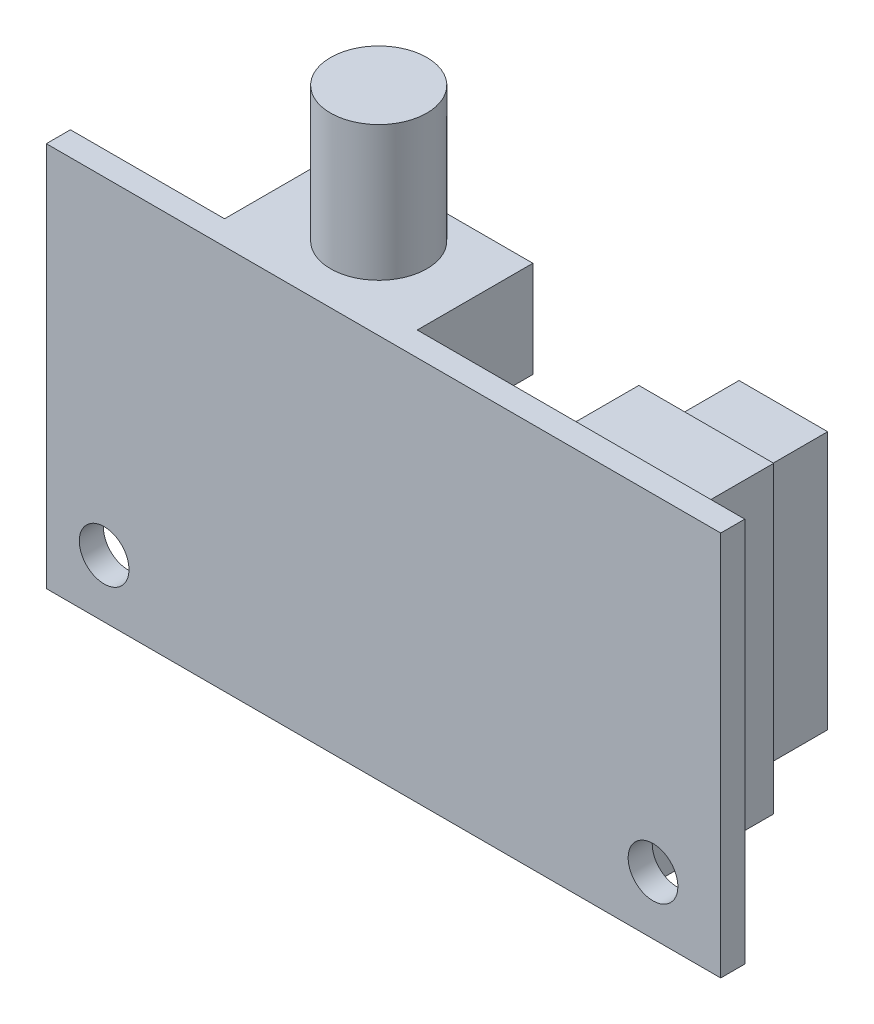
ISO-10303-21;
HEADER;
FILE_DESCRIPTION(('STEP AP214'),'2;1');
FILE_NAME('part.step','',(''),(''),'','','');
FILE_SCHEMA(('AUTOMOTIVE_DESIGN { 1 0 10303 214 1 1 1 1 }'));
ENDSEC;
DATA;
#1=APPLICATION_CONTEXT('core data for automotive mechanical design processes');
#2=APPLICATION_PROTOCOL_DEFINITION('international standard','automotive_design',2000,#1);
#3=PRODUCT_CONTEXT('',#1,'mechanical');
#4=PRODUCT('Part','Part','',(#3));
#5=PRODUCT_RELATED_PRODUCT_CATEGORY('part','',(#4));
#6=PRODUCT_DEFINITION_FORMATION('','',#4);
#7=PRODUCT_DEFINITION_CONTEXT('part definition',#1,'design');
#8=PRODUCT_DEFINITION('design','',#6,#7);
#9=PRODUCT_DEFINITION_SHAPE('','',#8);
#10=(LENGTH_UNIT() NAMED_UNIT(*) SI_UNIT(.MILLI.,.METRE.));
#11=(NAMED_UNIT(*) PLANE_ANGLE_UNIT() SI_UNIT($,.RADIAN.));
#12=(NAMED_UNIT(*) SI_UNIT($,.STERADIAN.) SOLID_ANGLE_UNIT());
#13=UNCERTAINTY_MEASURE_WITH_UNIT(LENGTH_MEASURE(1.E-05),#10,'distance_accuracy_value','');
#14=(GEOMETRIC_REPRESENTATION_CONTEXT(3) GLOBAL_UNCERTAINTY_ASSIGNED_CONTEXT((#13)) GLOBAL_UNIT_ASSIGNED_CONTEXT((#10,
#11,#12)) REPRESENTATION_CONTEXT('',''));
#15=CARTESIAN_POINT('',(0.,0.,0.));
#16=DIRECTION('',(0.,0.,1.));
#17=DIRECTION('',(1.,0.,0.));
#18=AXIS2_PLACEMENT_3D('',#15,#16,#17);
#19=CARTESIAN_POINT('',(-7.61999999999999,20.0152,-11.1125));
#20=DIRECTION('',(0.,0.,-1.));
#21=DIRECTION('',(-1.,0.,0.));
#22=AXIS2_PLACEMENT_3D('',#19,#20,#21);
#23=PLANE('',#22);
#24=DIRECTION('',(1.,0.,0.));
#25=VECTOR('',#24,1.);
#26=CARTESIAN_POINT('',(-16.51,20.0152,-11.1125));
#27=LINE('',#26,#25);
#28=CARTESIAN_POINT('',(-16.51,20.0152,-11.1125));
#29=VERTEX_POINT('',#28);
#30=CARTESIAN_POINT('',(-7.61999999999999,20.0152,-11.1125));
#31=VERTEX_POINT('',#30);
#32=EDGE_CURVE('E176',#29,#31,#27,.T.);
#33=ORIENTED_EDGE('',*,*,#32,.T.);
#34=DIRECTION('',(0.,-1.,0.));
#35=VECTOR('',#34,1.);
#36=CARTESIAN_POINT('',(-7.61999999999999,20.0152,-11.1125));
#37=LINE('',#36,#35);
#38=CARTESIAN_POINT('',(-7.61999999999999,0.,-11.1125));
#39=VERTEX_POINT('',#38);
#40=EDGE_CURVE('E179',#31,#39,#37,.T.);
#41=ORIENTED_EDGE('',*,*,#40,.T.);
#42=DIRECTION('',(-1.,0.,0.));
#43=VECTOR('',#42,1.);
#44=CARTESIAN_POINT('',(-7.61999999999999,0.,-11.1125));
#45=LINE('',#44,#43);
#46=CARTESIAN_POINT('',(-16.51,0.,-11.1125));
#47=VERTEX_POINT('',#46);
#48=EDGE_CURVE('E182',#39,#47,#45,.T.);
#49=ORIENTED_EDGE('',*,*,#48,.T.);
#50=DIRECTION('',(0.,1.,0.));
#51=VECTOR('',#50,1.);
#52=CARTESIAN_POINT('',(-16.51,0.,-11.1125));
#53=LINE('',#52,#51);
#54=EDGE_CURVE('E184',#47,#29,#53,.T.);
#55=ORIENTED_EDGE('',*,*,#54,.T.);
#56=EDGE_LOOP('',(#33,#41,#49,#55));
#57=FACE_BOUND('',#56,.T.);
#58=DIRECTION('',(1.,0.,0.));
#59=VECTOR('',#58,1.);
#60=CARTESIAN_POINT('',(-14.986,18.5166,-11.1125));
#61=LINE('',#60,#59);
#62=CARTESIAN_POINT('',(-14.986,18.5166,-11.1125));
#63=VERTEX_POINT('',#62);
#64=CARTESIAN_POINT('',(-9.14399999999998,18.5166,-11.1125));
#65=VERTEX_POINT('',#64);
#66=EDGE_CURVE('E528',#63,#65,#61,.T.);
#67=ORIENTED_EDGE('',*,*,#66,.F.);
#68=DIRECTION('',(0.,1.,0.));
#69=VECTOR('',#68,1.);
#70=CARTESIAN_POINT('',(-14.986,18.5166,-11.1125));
#71=LINE('',#70,#69);
#72=CARTESIAN_POINT('',(-14.986,1.4986,-11.1125));
#73=VERTEX_POINT('',#72);
#74=EDGE_CURVE('E167',#73,#63,#71,.T.);
#75=ORIENTED_EDGE('',*,*,#74,.F.);
#76=DIRECTION('',(-1.,0.,0.));
#77=VECTOR('',#76,1.);
#78=CARTESIAN_POINT('',(-14.986,1.4986,-11.1125));
#79=LINE('',#78,#77);
#80=CARTESIAN_POINT('',(-9.14399999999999,1.49860000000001,-11.1125));
#81=VERTEX_POINT('',#80);
#82=EDGE_CURVE('E163',#81,#73,#79,.T.);
#83=ORIENTED_EDGE('',*,*,#82,.F.);
#84=DIRECTION('',(0.,-1.,0.));
#85=VECTOR('',#84,1.);
#86=CARTESIAN_POINT('',(-9.14399999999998,18.5166,-11.1125));
#87=LINE('',#86,#85);
#88=EDGE_CURVE('E525',#65,#81,#87,.T.);
#89=ORIENTED_EDGE('',*,*,#88,.F.);
#90=EDGE_LOOP('',(#67,#75,#83,#89));
#91=FACE_BOUND('',#90,.T.);
#92=ADVANCED_FACE('F31',(#57,#91),#23,.T.);
#93=CARTESIAN_POINT('',(0.,7.84644021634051,-1.5875));
#94=DIRECTION('',(0.,0.,-1.));
#95=DIRECTION('',(-1.,0.,0.));
#96=AXIS2_PLACEMENT_3D('',#93,#94,#95);
#97=PLANE('',#96);
#98=CARTESIAN_POINT('',(-40.64,3.81,-1.5875));
#99=DIRECTION('',(0.,0.,-1.));
#100=DIRECTION('',(-1.,0.,0.));
#101=AXIS2_PLACEMENT_3D('',#98,#99,#100);
#102=CIRCLE('',#101,1.6383);
#103=CARTESIAN_POINT('',(-42.2783,3.81,-1.5875));
#104=VERTEX_POINT('',#103);
#105=EDGE_CURVE('E297',#104,#104,#102,.T.);
#106=ORIENTED_EDGE('',*,*,#105,.F.);
#107=EDGE_LOOP('',(#106));
#108=FACE_BOUND('',#107,.T.);
#109=CARTESIAN_POINT('',(-4.46387065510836,3.81,-1.5875));
#110=DIRECTION('',(0.,0.,-1.));
#111=DIRECTION('',(-1.,0.,0.));
#112=AXIS2_PLACEMENT_3D('',#109,#110,#111);
#113=CIRCLE('',#112,1.6383);
#114=CARTESIAN_POINT('',(-6.10217065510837,3.81,-1.5875));
#115=VERTEX_POINT('',#114);
#116=EDGE_CURVE('E251',#115,#115,#113,.T.);
#117=ORIENTED_EDGE('',*,*,#116,.F.);
#118=EDGE_LOOP('',(#117));
#119=FACE_BOUND('',#118,.T.);
#120=DIRECTION('',(-1.,0.,0.));
#121=VECTOR('',#120,1.);
#122=CARTESIAN_POINT('',(0.,0.,-1.5875));
#123=LINE('',#122,#121);
#124=CARTESIAN_POINT('',(0.,0.,-1.5875));
#125=VERTEX_POINT('',#124);
#126=CARTESIAN_POINT('',(-7.61999999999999,0.,-1.5875));
#127=VERTEX_POINT('',#126);
#128=EDGE_CURVE('E288',#125,#127,#123,.T.);
#129=ORIENTED_EDGE('',*,*,#128,.T.);
#130=DIRECTION('',(0.,-1.,0.));
#131=VECTOR('',#130,1.);
#132=CARTESIAN_POINT('',(-7.61999999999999,20.0152,-1.5875));
#133=LINE('',#132,#131);
#134=CARTESIAN_POINT('',(-7.61999999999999,20.0152,-1.5875));
#135=VERTEX_POINT('',#134);
#136=EDGE_CURVE('E54',#135,#127,#133,.T.);
#137=ORIENTED_EDGE('',*,*,#136,.F.);
#138=DIRECTION('',(1.,0.,0.));
#139=VECTOR('',#138,1.);
#140=CARTESIAN_POINT('',(-16.51,20.0152,-1.5875));
#141=LINE('',#140,#139);
#142=CARTESIAN_POINT('',(-16.51,20.0152,-1.5875));
#143=VERTEX_POINT('',#142);
#144=EDGE_CURVE('E169',#143,#135,#141,.T.);
#145=ORIENTED_EDGE('',*,*,#144,.F.);
#146=DIRECTION('',(0.,1.,0.));
#147=VECTOR('',#146,1.);
#148=CARTESIAN_POINT('',(-16.51,0.,-1.5875));
#149=LINE('',#148,#147);
#150=CARTESIAN_POINT('',(-16.51,0.,-1.5875));
#151=VERTEX_POINT('',#150);
#152=EDGE_CURVE('E180',#151,#143,#149,.T.);
#153=ORIENTED_EDGE('',*,*,#152,.F.);
#154=CARTESIAN_POINT('',(-44.45,0.,-1.5875));
#155=VERTEX_POINT('',#154);
#156=EDGE_CURVE('E256',#151,#155,#123,.T.);
#157=ORIENTED_EDGE('',*,*,#156,.T.);
#158=DIRECTION('',(0.,1.,0.));
#159=VECTOR('',#158,1.);
#160=CARTESIAN_POINT('',(-44.45,0.,-1.5875));
#161=LINE('',#160,#159);
#162=CARTESIAN_POINT('',(-44.45,25.4,-1.5875));
#163=VERTEX_POINT('',#162);
#164=EDGE_CURVE('E241',#155,#163,#161,.T.);
#165=ORIENTED_EDGE('',*,*,#164,.T.);
#166=DIRECTION('',(1.,0.,0.));
#167=VECTOR('',#166,1.);
#168=CARTESIAN_POINT('',(0.,25.4,-1.5875));
#169=LINE('',#168,#167);
#170=CARTESIAN_POINT('',(-34.29,25.4,-1.5875));
#171=VERTEX_POINT('',#170);
#172=EDGE_CURVE('E240',#163,#171,#169,.T.);
#173=ORIENTED_EDGE('',*,*,#172,.T.);
#174=DIRECTION('',(0.,1.,0.));
#175=VECTOR('',#174,1.);
#176=CARTESIAN_POINT('',(-34.29,19.05,-1.5875));
#177=LINE('',#176,#175);
#178=CARTESIAN_POINT('',(-34.29,19.05,-1.5875));
#179=VERTEX_POINT('',#178);
#180=EDGE_CURVE('E203',#179,#171,#177,.T.);
#181=ORIENTED_EDGE('',*,*,#180,.F.);
#182=DIRECTION('',(-1.,0.,0.));
#183=VECTOR('',#182,1.);
#184=CARTESIAN_POINT('',(-34.29,19.05,-1.5875));
#185=LINE('',#184,#183);
#186=CARTESIAN_POINT('',(-21.59,19.05,-1.5875));
#187=VERTEX_POINT('',#186);
#188=EDGE_CURVE('E208',#187,#179,#185,.T.);
#189=ORIENTED_EDGE('',*,*,#188,.F.);
#190=DIRECTION('',(0.,-1.,0.));
#191=VECTOR('',#190,1.);
#192=CARTESIAN_POINT('',(-21.59,19.05,-1.5875));
#193=LINE('',#192,#191);
#194=CARTESIAN_POINT('',(-21.59,25.4,-1.5875));
#195=VERTEX_POINT('',#194);
#196=EDGE_CURVE('E220',#195,#187,#193,.T.);
#197=ORIENTED_EDGE('',*,*,#196,.F.);
#198=CARTESIAN_POINT('',(0.,25.4,-1.5875));
#199=VERTEX_POINT('',#198);
#200=EDGE_CURVE('E237',#195,#199,#169,.T.);
#201=ORIENTED_EDGE('',*,*,#200,.T.);
#202=DIRECTION('',(0.,1.,0.));
#203=VECTOR('',#202,1.);
#204=CARTESIAN_POINT('',(0.,25.3365678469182,-1.5875));
#205=LINE('',#204,#203);
#206=EDGE_CURVE('E39',#125,#199,#205,.T.);
#207=ORIENTED_EDGE('',*,*,#206,.F.);
#208=EDGE_LOOP('',(#129,#137,#145,#153,#157,#165,#173,#181,#189,#197,#201,#207));
#209=FACE_BOUND('',#208,.T.);
#210=ADVANCED_FACE('F287',(#108,#119,#209),#97,.T.);
#211=CARTESIAN_POINT('',(0.,25.4,-1.5875));
#212=DIRECTION('',(0.,-1.,0.));
#213=DIRECTION('',(0.,0.,-1.));
#214=AXIS2_PLACEMENT_3D('',#211,#212,#213);
#215=PLANE('',#214);
#216=DIRECTION('',(1.,0.,0.));
#217=VECTOR('',#216,1.);
#218=CARTESIAN_POINT('',(0.,25.4,0.));
#219=LINE('',#218,#217);
#220=CARTESIAN_POINT('',(-44.45,25.4,0.));
#221=VERTEX_POINT('',#220);
#222=CARTESIAN_POINT('',(0.,25.4,0.));
#223=VERTEX_POINT('',#222);
#224=EDGE_CURVE('E253',#221,#223,#219,.T.);
#225=ORIENTED_EDGE('',*,*,#224,.T.);
#226=DIRECTION('',(0.,0.,1.));
#227=VECTOR('',#226,1.);
#228=CARTESIAN_POINT('',(0.,25.4,-1.5875));
#229=LINE('',#228,#227);
#230=EDGE_CURVE('E257',#199,#223,#229,.T.);
#231=ORIENTED_EDGE('',*,*,#230,.F.);
#232=ORIENTED_EDGE('',*,*,#200,.F.);
#233=DIRECTION('',(0.,0.,1.));
#234=VECTOR('',#233,1.);
#235=CARTESIAN_POINT('',(-21.59,25.4,-9.2075));
#236=LINE('',#235,#234);
#237=CARTESIAN_POINT('',(-21.59,25.4,-9.2075));
#238=VERTEX_POINT('',#237);
#239=EDGE_CURVE('E227',#238,#195,#236,.T.);
#240=ORIENTED_EDGE('',*,*,#239,.F.);
#241=DIRECTION('',(1.,0.,0.));
#242=VECTOR('',#241,1.);
#243=CARTESIAN_POINT('',(-34.29,25.4,-9.2075));
#244=LINE('',#243,#242);
#245=CARTESIAN_POINT('',(-34.29,25.4,-9.2075));
#246=VERTEX_POINT('',#245);
#247=EDGE_CURVE('E207',#246,#238,#244,.T.);
#248=ORIENTED_EDGE('',*,*,#247,.F.);
#249=DIRECTION('',(0.,0.,1.));
#250=VECTOR('',#249,1.);
#251=CARTESIAN_POINT('',(-34.29,25.4,-9.2075));
#252=LINE('',#251,#250);
#253=EDGE_CURVE('E223',#246,#171,#252,.T.);
#254=ORIENTED_EDGE('',*,*,#253,.T.);
#255=ORIENTED_EDGE('',*,*,#172,.F.);
#256=DIRECTION('',(0.,0.,1.));
#257=VECTOR('',#256,1.);
#258=CARTESIAN_POINT('',(-44.45,25.4,-1.5875));
#259=LINE('',#258,#257);
#260=EDGE_CURVE('E260',#163,#221,#259,.T.);
#261=ORIENTED_EDGE('',*,*,#260,.T.);
#262=EDGE_LOOP('',(#225,#231,#232,#240,#248,#254,#255,#261));
#263=FACE_BOUND('',#262,.T.);
#264=CARTESIAN_POINT('',(-27.94,25.4,-5.3975));
#265=DIRECTION('',(0.,-1.,0.));
#266=DIRECTION('',(0.,0.,-1.));
#267=AXIS2_PLACEMENT_3D('',#264,#265,#266);
#268=CIRCLE('',#267,3.175);
#269=CARTESIAN_POINT('',(-27.94,25.4,-8.5725));
#270=VERTEX_POINT('',#269);
#271=EDGE_CURVE('E11',#270,#270,#268,.F.);
#272=ORIENTED_EDGE('',*,*,#271,.F.);
#273=EDGE_LOOP('',(#272));
#274=FACE_BOUND('',#273,.T.);
#275=ADVANCED_FACE('F281',(#263,#274),#215,.F.);
#276=CARTESIAN_POINT('',(0.,7.84644021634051,0.));
#277=DIRECTION('',(0.,0.,-1.));
#278=DIRECTION('',(-1.,0.,0.));
#279=AXIS2_PLACEMENT_3D('',#276,#277,#278);
#280=PLANE('',#279);
#281=CARTESIAN_POINT('',(-4.46387065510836,3.81,0.));
#282=DIRECTION('',(0.,0.,-1.));
#283=DIRECTION('',(-1.,0.,0.));
#284=AXIS2_PLACEMENT_3D('',#281,#282,#283);
#285=CIRCLE('',#284,1.6383);
#286=CARTESIAN_POINT('',(-6.10217065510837,3.81,0.));
#287=VERTEX_POINT('',#286);
#288=EDGE_CURVE('E294',#287,#287,#285,.T.);
#289=ORIENTED_EDGE('',*,*,#288,.T.);
#290=EDGE_LOOP('',(#289));
#291=FACE_BOUND('',#290,.T.);
#292=DIRECTION('',(-1.,0.,0.));
#293=VECTOR('',#292,1.);
#294=CARTESIAN_POINT('',(0.,0.,0.));
#295=LINE('',#294,#293);
#296=CARTESIAN_POINT('',(0.,0.,0.));
#297=VERTEX_POINT('',#296);
#298=CARTESIAN_POINT('',(-44.45,0.,0.));
#299=VERTEX_POINT('',#298);
#300=EDGE_CURVE('E247',#297,#299,#295,.T.);
#301=ORIENTED_EDGE('',*,*,#300,.F.);
#302=DIRECTION('',(0.,1.,0.));
#303=VECTOR('',#302,1.);
#304=CARTESIAN_POINT('',(0.,25.3365678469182,0.));
#305=LINE('',#304,#303);
#306=EDGE_CURVE('E269',#297,#223,#305,.T.);
#307=ORIENTED_EDGE('',*,*,#306,.T.);
#308=ORIENTED_EDGE('',*,*,#224,.F.);
#309=DIRECTION('',(0.,1.,0.));
#310=VECTOR('',#309,1.);
#311=CARTESIAN_POINT('',(-44.45,0.,0.));
#312=LINE('',#311,#310);
#313=EDGE_CURVE('E250',#299,#221,#312,.T.);
#314=ORIENTED_EDGE('',*,*,#313,.F.);
#315=EDGE_LOOP('',(#301,#307,#308,#314));
#316=FACE_BOUND('',#315,.T.);
#317=CARTESIAN_POINT('',(-40.64,3.81,0.));
#318=DIRECTION('',(0.,0.,-1.));
#319=DIRECTION('',(-1.,0.,0.));
#320=AXIS2_PLACEMENT_3D('',#317,#318,#319);
#321=CIRCLE('',#320,1.6383);
#322=CARTESIAN_POINT('',(-42.2783,3.81,0.));
#323=VERTEX_POINT('',#322);
#324=EDGE_CURVE('E226',#323,#323,#321,.T.);
#325=ORIENTED_EDGE('',*,*,#324,.T.);
#326=EDGE_LOOP('',(#325));
#327=FACE_BOUND('',#326,.T.);
#328=ADVANCED_FACE('F274',(#291,#316,#327),#280,.F.);
#329=CARTESIAN_POINT('',(0.,0.,-1.5875));
#330=DIRECTION('',(0.,1.,0.));
#331=DIRECTION('',(0.,0.,1.));
#332=AXIS2_PLACEMENT_3D('',#329,#330,#331);
#333=PLANE('',#332);
#334=ORIENTED_EDGE('',*,*,#300,.T.);
#335=DIRECTION('',(0.,0.,1.));
#336=VECTOR('',#335,1.);
#337=CARTESIAN_POINT('',(-44.45,0.,-1.5875));
#338=LINE('',#337,#336);
#339=EDGE_CURVE('E263',#155,#299,#338,.T.);
#340=ORIENTED_EDGE('',*,*,#339,.F.);
#341=ORIENTED_EDGE('',*,*,#156,.F.);
#342=DIRECTION('',(0.,0.,1.));
#343=VECTOR('',#342,1.);
#344=CARTESIAN_POINT('',(-16.51,0.,-11.1125));
#345=LINE('',#344,#343);
#346=EDGE_CURVE('E192',#47,#151,#345,.T.);
#347=ORIENTED_EDGE('',*,*,#346,.F.);
#348=ORIENTED_EDGE('',*,*,#48,.F.);
#349=DIRECTION('',(0.,0.,1.));
#350=VECTOR('',#349,1.);
#351=CARTESIAN_POINT('',(-7.61999999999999,0.,-11.1125));
#352=LINE('',#351,#350);
#353=EDGE_CURVE('E195',#39,#127,#352,.T.);
#354=ORIENTED_EDGE('',*,*,#353,.T.);
#355=ORIENTED_EDGE('',*,*,#128,.F.);
#356=DIRECTION('',(0.,0.,1.));
#357=VECTOR('',#356,1.);
#358=CARTESIAN_POINT('',(0.,0.,-1.5875));
#359=LINE('',#358,#357);
#360=EDGE_CURVE('E266',#125,#297,#359,.T.);
#361=ORIENTED_EDGE('',*,*,#360,.T.);
#362=EDGE_LOOP('',(#334,#340,#341,#347,#348,#354,#355,#361));
#363=FACE_BOUND('',#362,.T.);
#364=ADVANCED_FACE('F290',(#363),#333,.F.);
#365=CARTESIAN_POINT('',(-44.45,0.,-1.5875));
#366=DIRECTION('',(1.,0.,0.));
#367=DIRECTION('',(0.,0.,-1.));
#368=AXIS2_PLACEMENT_3D('',#365,#366,#367);
#369=PLANE('',#368);
#370=ORIENTED_EDGE('',*,*,#313,.T.);
#371=ORIENTED_EDGE('',*,*,#260,.F.);
#372=ORIENTED_EDGE('',*,*,#164,.F.);
#373=ORIENTED_EDGE('',*,*,#339,.T.);
#374=EDGE_LOOP('',(#370,#371,#372,#373));
#375=FACE_BOUND('',#374,.T.);
#376=ADVANCED_FACE('F374',(#375),#369,.F.);
#377=CARTESIAN_POINT('',(0.,25.3365678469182,-1.5875));
#378=DIRECTION('',(1.,0.,0.));
#379=DIRECTION('',(0.,0.,-1.));
#380=AXIS2_PLACEMENT_3D('',#377,#378,#379);
#381=PLANE('',#380);
#382=ORIENTED_EDGE('',*,*,#306,.F.);
#383=ORIENTED_EDGE('',*,*,#360,.F.);
#384=ORIENTED_EDGE('',*,*,#206,.T.);
#385=ORIENTED_EDGE('',*,*,#230,.T.);
#386=EDGE_LOOP('',(#382,#383,#384,#385));
#387=FACE_BOUND('',#386,.T.);
#388=ADVANCED_FACE('F33',(#387),#381,.T.);
#389=CARTESIAN_POINT('',(-4.46387065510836,3.81,-1.5875));
#390=DIRECTION('',(0.,0.,1.));
#391=DIRECTION('',(1.,0.,0.));
#392=AXIS2_PLACEMENT_3D('',#389,#390,#391);
#393=CYLINDRICAL_SURFACE('',#392,1.6383);
#394=ORIENTED_EDGE('',*,*,#116,.T.);
#395=EDGE_LOOP('',(#394));
#396=FACE_BOUND('',#395,.T.);
#397=ORIENTED_EDGE('',*,*,#288,.F.);
#398=EDGE_LOOP('',(#397));
#399=FACE_BOUND('',#398,.T.);
#400=ADVANCED_FACE('F372',(#396,#399),#393,.F.);
#401=CARTESIAN_POINT('',(-40.64,3.81,-1.5875));
#402=DIRECTION('',(0.,0.,1.));
#403=DIRECTION('',(1.,0.,0.));
#404=AXIS2_PLACEMENT_3D('',#401,#402,#403);
#405=CYLINDRICAL_SURFACE('',#404,1.6383);
#406=ORIENTED_EDGE('',*,*,#105,.T.);
#407=EDGE_LOOP('',(#406));
#408=FACE_BOUND('',#407,.T.);
#409=ORIENTED_EDGE('',*,*,#324,.F.);
#410=EDGE_LOOP('',(#409));
#411=FACE_BOUND('',#410,.T.);
#412=ADVANCED_FACE('F400',(#408,#411),#405,.F.);
#413=CARTESIAN_POINT('',(-34.29,19.05,-9.2075));
#414=DIRECTION('',(1.,0.,0.));
#415=DIRECTION('',(0.,0.,-1.));
#416=AXIS2_PLACEMENT_3D('',#413,#414,#415);
#417=PLANE('',#416);
#418=ORIENTED_EDGE('',*,*,#180,.T.);
#419=ORIENTED_EDGE('',*,*,#253,.F.);
#420=DIRECTION('',(0.,1.,0.));
#421=VECTOR('',#420,1.);
#422=CARTESIAN_POINT('',(-34.29,19.05,-9.2075));
#423=LINE('',#422,#421);
#424=CARTESIAN_POINT('',(-34.29,19.05,-9.2075));
#425=VERTEX_POINT('',#424);
#426=EDGE_CURVE('E204',#425,#246,#423,.T.);
#427=ORIENTED_EDGE('',*,*,#426,.F.);
#428=DIRECTION('',(0.,0.,1.));
#429=VECTOR('',#428,1.);
#430=CARTESIAN_POINT('',(-34.29,19.05,-9.2075));
#431=LINE('',#430,#429);
#432=EDGE_CURVE('E214',#425,#179,#431,.T.);
#433=ORIENTED_EDGE('',*,*,#432,.T.);
#434=EDGE_LOOP('',(#418,#419,#427,#433));
#435=FACE_BOUND('',#434,.T.);
#436=ADVANCED_FACE('F309',(#435),#417,.F.);
#437=CARTESIAN_POINT('',(-21.59,19.05,-9.2075));
#438=DIRECTION('',(-1.,0.,0.));
#439=DIRECTION('',(0.,0.,1.));
#440=AXIS2_PLACEMENT_3D('',#437,#438,#439);
#441=PLANE('',#440);
#442=ORIENTED_EDGE('',*,*,#196,.T.);
#443=DIRECTION('',(0.,0.,1.));
#444=VECTOR('',#443,1.);
#445=CARTESIAN_POINT('',(-21.59,19.05,-9.2075));
#446=LINE('',#445,#444);
#447=CARTESIAN_POINT('',(-21.59,19.05,-9.2075));
#448=VERTEX_POINT('',#447);
#449=EDGE_CURVE('E232',#448,#187,#446,.T.);
#450=ORIENTED_EDGE('',*,*,#449,.F.);
#451=DIRECTION('',(0.,-1.,0.));
#452=VECTOR('',#451,1.);
#453=CARTESIAN_POINT('',(-21.59,19.05,-9.2075));
#454=LINE('',#453,#452);
#455=EDGE_CURVE('E210',#238,#448,#454,.T.);
#456=ORIENTED_EDGE('',*,*,#455,.F.);
#457=ORIENTED_EDGE('',*,*,#239,.T.);
#458=EDGE_LOOP('',(#442,#450,#456,#457));
#459=FACE_BOUND('',#458,.T.);
#460=ADVANCED_FACE('F317',(#459),#441,.F.);
#461=CARTESIAN_POINT('',(-34.29,19.05,-9.2075));
#462=DIRECTION('',(0.,1.,0.));
#463=DIRECTION('',(0.,0.,1.));
#464=AXIS2_PLACEMENT_3D('',#461,#462,#463);
#465=PLANE('',#464);
#466=ORIENTED_EDGE('',*,*,#188,.T.);
#467=ORIENTED_EDGE('',*,*,#432,.F.);
#468=DIRECTION('',(-1.,0.,0.));
#469=VECTOR('',#468,1.);
#470=CARTESIAN_POINT('',(-34.29,19.05,-9.2075));
#471=LINE('',#470,#469);
#472=EDGE_CURVE('E212',#448,#425,#471,.T.);
#473=ORIENTED_EDGE('',*,*,#472,.F.);
#474=ORIENTED_EDGE('',*,*,#449,.T.);
#475=EDGE_LOOP('',(#466,#467,#473,#474));
#476=FACE_BOUND('',#475,.T.);
#477=ADVANCED_FACE('F314',(#476),#465,.F.);
#478=CARTESIAN_POINT('',(-34.29,19.05,-9.2075));
#479=DIRECTION('',(0.,0.,-1.));
#480=DIRECTION('',(-1.,0.,0.));
#481=AXIS2_PLACEMENT_3D('',#478,#479,#480);
#482=PLANE('',#481);
#483=ORIENTED_EDGE('',*,*,#426,.T.);
#484=ORIENTED_EDGE('',*,*,#247,.T.);
#485=ORIENTED_EDGE('',*,*,#455,.T.);
#486=ORIENTED_EDGE('',*,*,#472,.T.);
#487=EDGE_LOOP('',(#483,#484,#485,#486));
#488=FACE_BOUND('',#487,.T.);
#489=ADVANCED_FACE('F321',(#488),#482,.T.);
#490=CARTESIAN_POINT('',(-27.94,34.29,-5.3975));
#491=DIRECTION('',(0.,-1.,0.));
#492=DIRECTION('',(1.,0.,0.));
#493=AXIS2_PLACEMENT_3D('',#490,#491,#492);
#494=CYLINDRICAL_SURFACE('',#493,3.175);
#495=CARTESIAN_POINT('',(-27.94,34.29,-5.3975));
#496=DIRECTION('',(0.,1.,0.));
#497=DIRECTION('',(-1.,0.,0.));
#498=AXIS2_PLACEMENT_3D('',#495,#496,#497);
#499=CIRCLE('',#498,3.175);
#500=CARTESIAN_POINT('',(-31.115,34.29,-5.3975));
#501=VERTEX_POINT('',#500);
#502=EDGE_CURVE('E200',#501,#501,#499,.T.);
#503=ORIENTED_EDGE('',*,*,#502,.F.);
#504=EDGE_LOOP('',(#503));
#505=FACE_BOUND('',#504,.T.);
#506=ORIENTED_EDGE('',*,*,#271,.T.);
#507=EDGE_LOOP('',(#506));
#508=FACE_BOUND('',#507,.T.);
#509=ADVANCED_FACE('F323',(#505,#508),#494,.T.);
#510=CARTESIAN_POINT('',(-27.94,34.29,-5.3975));
#511=DIRECTION('',(0.,1.,0.));
#512=DIRECTION('',(-1.,0.,0.));
#513=AXIS2_PLACEMENT_3D('',#510,#511,#512);
#514=PLANE('',#513);
#515=ORIENTED_EDGE('',*,*,#502,.T.);
#516=EDGE_LOOP('',(#515));
#517=FACE_BOUND('',#516,.T.);
#518=ADVANCED_FACE('F329',(#517),#514,.T.);
#519=CARTESIAN_POINT('',(-16.51,20.0152,-11.1125));
#520=DIRECTION('',(0.,-1.,0.));
#521=DIRECTION('',(1.,0.,0.));
#522=AXIS2_PLACEMENT_3D('',#519,#520,#521);
#523=PLANE('',#522);
#524=ORIENTED_EDGE('',*,*,#144,.T.);
#525=DIRECTION('',(0.,0.,1.));
#526=VECTOR('',#525,1.);
#527=CARTESIAN_POINT('',(-7.61999999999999,20.0152,-11.1125));
#528=LINE('',#527,#526);
#529=EDGE_CURVE('E198',#31,#135,#528,.T.);
#530=ORIENTED_EDGE('',*,*,#529,.F.);
#531=ORIENTED_EDGE('',*,*,#32,.F.);
#532=DIRECTION('',(0.,0.,1.));
#533=VECTOR('',#532,1.);
#534=CARTESIAN_POINT('',(-16.51,20.0152,-11.1125));
#535=LINE('',#534,#533);
#536=EDGE_CURVE('E185',#29,#143,#535,.T.);
#537=ORIENTED_EDGE('',*,*,#536,.T.);
#538=EDGE_LOOP('',(#524,#530,#531,#537));
#539=FACE_BOUND('',#538,.T.);
#540=ADVANCED_FACE('F352',(#539),#523,.F.);
#541=CARTESIAN_POINT('',(-7.61999999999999,20.0152,-11.1125));
#542=DIRECTION('',(-1.,0.,0.));
#543=DIRECTION('',(0.,-1.,0.));
#544=AXIS2_PLACEMENT_3D('',#541,#542,#543);
#545=PLANE('',#544);
#546=ORIENTED_EDGE('',*,*,#136,.T.);
#547=ORIENTED_EDGE('',*,*,#353,.F.);
#548=ORIENTED_EDGE('',*,*,#40,.F.);
#549=ORIENTED_EDGE('',*,*,#529,.T.);
#550=EDGE_LOOP('',(#546,#547,#548,#549));
#551=FACE_BOUND('',#550,.T.);
#552=ADVANCED_FACE('F348',(#551),#545,.F.);
#553=CARTESIAN_POINT('',(-16.51,0.,-11.1125));
#554=DIRECTION('',(1.,0.,0.));
#555=DIRECTION('',(0.,0.,-1.));
#556=AXIS2_PLACEMENT_3D('',#553,#554,#555);
#557=PLANE('',#556);
#558=ORIENTED_EDGE('',*,*,#152,.T.);
#559=ORIENTED_EDGE('',*,*,#536,.F.);
#560=ORIENTED_EDGE('',*,*,#54,.F.);
#561=ORIENTED_EDGE('',*,*,#346,.T.);
#562=EDGE_LOOP('',(#558,#559,#560,#561));
#563=FACE_BOUND('',#562,.T.);
#564=ADVANCED_FACE('F345',(#563),#557,.F.);
#565=CARTESIAN_POINT('',(-14.986,18.5166,-16.1925));
#566=DIRECTION('',(1.,0.,0.));
#567=DIRECTION('',(0.,1.,0.));
#568=AXIS2_PLACEMENT_3D('',#565,#566,#567);
#569=PLANE('',#568);
#570=ORIENTED_EDGE('',*,*,#74,.T.);
#571=DIRECTION('',(0.,0.,1.));
#572=VECTOR('',#571,1.);
#573=CARTESIAN_POINT('',(-14.986,18.5166,-16.1925));
#574=LINE('',#573,#572);
#575=CARTESIAN_POINT('',(-14.986,18.5166,-16.1925));
#576=VERTEX_POINT('',#575);
#577=EDGE_CURVE('E148',#576,#63,#574,.T.);
#578=ORIENTED_EDGE('',*,*,#577,.F.);
#579=DIRECTION('',(0.,1.,0.));
#580=VECTOR('',#579,1.);
#581=CARTESIAN_POINT('',(-14.986,18.5166,-16.1925));
#582=LINE('',#581,#580);
#583=CARTESIAN_POINT('',(-14.986,1.4986,-16.1925));
#584=VERTEX_POINT('',#583);
#585=EDGE_CURVE('E155',#584,#576,#582,.T.);
#586=ORIENTED_EDGE('',*,*,#585,.F.);
#587=DIRECTION('',(0.,0.,1.));
#588=VECTOR('',#587,1.);
#589=CARTESIAN_POINT('',(-14.986,1.4986,-16.1925));
#590=LINE('',#589,#588);
#591=EDGE_CURVE('E523',#584,#73,#590,.T.);
#592=ORIENTED_EDGE('',*,*,#591,.T.);
#593=EDGE_LOOP('',(#570,#578,#586,#592));
#594=FACE_BOUND('',#593,.T.);
#595=ADVANCED_FACE('F165',(#594),#569,.F.);
#596=CARTESIAN_POINT('',(-14.986,18.5166,-16.1925));
#597=DIRECTION('',(0.,-1.,0.));
#598=DIRECTION('',(1.,0.,0.));
#599=AXIS2_PLACEMENT_3D('',#596,#597,#598);
#600=PLANE('',#599);
#601=ORIENTED_EDGE('',*,*,#66,.T.);
#602=DIRECTION('',(0.,0.,1.));
#603=VECTOR('',#602,1.);
#604=CARTESIAN_POINT('',(-9.14399999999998,18.5166,-16.1925));
#605=LINE('',#604,#603);
#606=CARTESIAN_POINT('',(-9.14399999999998,18.5166,-16.1925));
#607=VERTEX_POINT('',#606);
#608=EDGE_CURVE('E151',#607,#65,#605,.T.);
#609=ORIENTED_EDGE('',*,*,#608,.F.);
#610=DIRECTION('',(1.,0.,0.));
#611=VECTOR('',#610,1.);
#612=CARTESIAN_POINT('',(-14.986,18.5166,-16.1925));
#613=LINE('',#612,#611);
#614=EDGE_CURVE('E144',#576,#607,#613,.T.);
#615=ORIENTED_EDGE('',*,*,#614,.F.);
#616=ORIENTED_EDGE('',*,*,#577,.T.);
#617=EDGE_LOOP('',(#601,#609,#615,#616));
#618=FACE_BOUND('',#617,.T.);
#619=ADVANCED_FACE('F146',(#618),#600,.F.);
#620=CARTESIAN_POINT('',(-9.14399999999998,18.5166,-16.1925));
#621=DIRECTION('',(-1.,0.,0.));
#622=DIRECTION('',(0.,-1.,0.));
#623=AXIS2_PLACEMENT_3D('',#620,#621,#622);
#624=PLANE('',#623);
#625=ORIENTED_EDGE('',*,*,#88,.T.);
#626=DIRECTION('',(0.,0.,1.));
#627=VECTOR('',#626,1.);
#628=CARTESIAN_POINT('',(-9.14399999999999,1.49860000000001,-16.1925));
#629=LINE('',#628,#627);
#630=CARTESIAN_POINT('',(-9.14399999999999,1.49860000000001,-16.1925));
#631=VERTEX_POINT('',#630);
#632=EDGE_CURVE('E46',#631,#81,#629,.T.);
#633=ORIENTED_EDGE('',*,*,#632,.F.);
#634=DIRECTION('',(0.,-1.,0.));
#635=VECTOR('',#634,1.);
#636=CARTESIAN_POINT('',(-9.14399999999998,18.5166,-16.1925));
#637=LINE('',#636,#635);
#638=EDGE_CURVE('E154',#607,#631,#637,.T.);
#639=ORIENTED_EDGE('',*,*,#638,.F.);
#640=ORIENTED_EDGE('',*,*,#608,.T.);
#641=EDGE_LOOP('',(#625,#633,#639,#640));
#642=FACE_BOUND('',#641,.T.);
#643=ADVANCED_FACE('F490',(#642),#624,.F.);
#644=CARTESIAN_POINT('',(-14.986,1.4986,-16.1925));
#645=DIRECTION('',(0.,1.,0.));
#646=DIRECTION('',(-1.,0.,0.));
#647=AXIS2_PLACEMENT_3D('',#644,#645,#646);
#648=PLANE('',#647);
#649=ORIENTED_EDGE('',*,*,#82,.T.);
#650=ORIENTED_EDGE('',*,*,#591,.F.);
#651=DIRECTION('',(-1.,0.,0.));
#652=VECTOR('',#651,1.);
#653=CARTESIAN_POINT('',(-14.986,1.4986,-16.1925));
#654=LINE('',#653,#652);
#655=EDGE_CURVE('E159',#631,#584,#654,.T.);
#656=ORIENTED_EDGE('',*,*,#655,.F.);
#657=ORIENTED_EDGE('',*,*,#632,.T.);
#658=EDGE_LOOP('',(#649,#650,#656,#657));
#659=FACE_BOUND('',#658,.T.);
#660=ADVANCED_FACE('F497',(#659),#648,.F.);
#661=CARTESIAN_POINT('',(-14.986,1.4986,-16.1925));
#662=DIRECTION('',(0.,0.,1.));
#663=DIRECTION('',(1.,0.,0.));
#664=AXIS2_PLACEMENT_3D('',#661,#662,#663);
#665=PLANE('',#664);
#666=ORIENTED_EDGE('',*,*,#585,.T.);
#667=ORIENTED_EDGE('',*,*,#614,.T.);
#668=ORIENTED_EDGE('',*,*,#638,.T.);
#669=ORIENTED_EDGE('',*,*,#655,.T.);
#670=EDGE_LOOP('',(#666,#667,#668,#669));
#671=FACE_BOUND('',#670,.T.);
#672=ADVANCED_FACE('F158',(#671),#665,.F.);
#673=CLOSED_SHELL('',(#92,#210,#275,#328,#364,#376,#388,#400,#412,#436,#460,#477,#489,#509,#518,
#540,#552,#564,#595,#619,#643,#660,#672));
#674=MANIFOLD_SOLID_BREP('B2',#673);
#675=ADVANCED_BREP_SHAPE_REPRESENTATION('',(#18,#674),#14);
#676=SHAPE_DEFINITION_REPRESENTATION(#9,#675);
ENDSEC;
END-ISO-10303-21;
